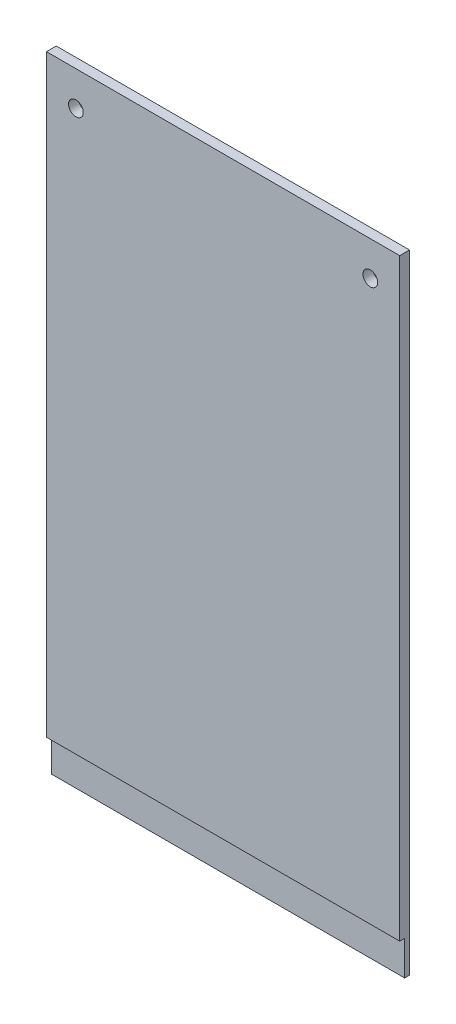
ISO-10303-21;
HEADER;
FILE_DESCRIPTION(('STEP AP214'),'2;1');
FILE_NAME('part.step','',(''),(''),'','','');
FILE_SCHEMA(('AUTOMOTIVE_DESIGN { 1 0 10303 214 1 1 1 1 }'));
ENDSEC;
DATA;
#1=APPLICATION_CONTEXT('core data for automotive mechanical design processes');
#2=APPLICATION_PROTOCOL_DEFINITION('international standard','automotive_design',2000,#1);
#3=PRODUCT_CONTEXT('',#1,'mechanical');
#4=PRODUCT('Part','Part','',(#3));
#5=PRODUCT_RELATED_PRODUCT_CATEGORY('part','',(#4));
#6=PRODUCT_DEFINITION_FORMATION('','',#4);
#7=PRODUCT_DEFINITION_CONTEXT('part definition',#1,'design');
#8=PRODUCT_DEFINITION('design','',#6,#7);
#9=PRODUCT_DEFINITION_SHAPE('','',#8);
#10=(LENGTH_UNIT() NAMED_UNIT(*) SI_UNIT(.MILLI.,.METRE.));
#11=(NAMED_UNIT(*) PLANE_ANGLE_UNIT() SI_UNIT($,.RADIAN.));
#12=(NAMED_UNIT(*) SI_UNIT($,.STERADIAN.) SOLID_ANGLE_UNIT());
#13=UNCERTAINTY_MEASURE_WITH_UNIT(LENGTH_MEASURE(1.E-05),#10,'distance_accuracy_value','');
#14=(GEOMETRIC_REPRESENTATION_CONTEXT(3) GLOBAL_UNCERTAINTY_ASSIGNED_CONTEXT((#13)) GLOBAL_UNIT_ASSIGNED_CONTEXT((#10,
#11,#12)) REPRESENTATION_CONTEXT('',''));
#15=CARTESIAN_POINT('',(0.,0.,0.));
#16=DIRECTION('',(0.,0.,1.));
#17=DIRECTION('',(1.,0.,0.));
#18=AXIS2_PLACEMENT_3D('',#15,#16,#17);
#19=CARTESIAN_POINT('',(36.,124.5,2.));
#20=DIRECTION('',(-1.,0.,0.));
#21=DIRECTION('',(0.,-1.,0.));
#22=AXIS2_PLACEMENT_3D('',#19,#20,#21);
#23=PLANE('',#22);
#24=DIRECTION('',(0.,1.,0.));
#25=VECTOR('',#24,1.);
#26=CARTESIAN_POINT('',(36.,124.5,0.));
#27=LINE('',#26,#25);
#28=CARTESIAN_POINT('',(36.,-4.49999999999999,0.));
#29=VERTEX_POINT('',#28);
#30=CARTESIAN_POINT('',(36.,123.5,0.));
#31=VERTEX_POINT('',#30);
#32=EDGE_CURVE('E142',#29,#31,#27,.T.);
#33=ORIENTED_EDGE('',*,*,#32,.T.);
#34=DIRECTION('',(0.,0.,-1.));
#35=VECTOR('',#34,1.);
#36=CARTESIAN_POINT('',(36.,123.5,2.));
#37=LINE('',#36,#35);
#38=CARTESIAN_POINT('',(36.,123.5,2.));
#39=VERTEX_POINT('',#38);
#40=EDGE_CURVE('E53',#39,#31,#37,.T.);
#41=ORIENTED_EDGE('',*,*,#40,.F.);
#42=DIRECTION('',(0.,1.,0.));
#43=VECTOR('',#42,1.);
#44=CARTESIAN_POINT('',(36.,124.5,2.));
#45=LINE('',#44,#43);
#46=CARTESIAN_POINT('',(36.,2.49999999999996,2.));
#47=VERTEX_POINT('',#46);
#48=EDGE_CURVE('E45',#47,#39,#45,.T.);
#49=ORIENTED_EDGE('',*,*,#48,.F.);
#50=DIRECTION('',(0.,0.,1.));
#51=VECTOR('',#50,1.);
#52=CARTESIAN_POINT('',(36.,2.49999999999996,0.999999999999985));
#53=LINE('',#52,#51);
#54=CARTESIAN_POINT('',(36.,2.49999999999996,0.999999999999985));
#55=VERTEX_POINT('',#54);
#56=EDGE_CURVE('E61',#55,#47,#53,.T.);
#57=ORIENTED_EDGE('',*,*,#56,.F.);
#58=DIRECTION('',(0.,1.,0.));
#59=VECTOR('',#58,1.);
#60=CARTESIAN_POINT('',(36.,-3.00000000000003,0.999999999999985));
#61=LINE('',#60,#59);
#62=CARTESIAN_POINT('',(36.,-4.49999999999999,1.));
#63=VERTEX_POINT('',#62);
#64=EDGE_CURVE('E118',#63,#55,#61,.T.);
#65=ORIENTED_EDGE('',*,*,#64,.F.);
#66=DIRECTION('',(0.,0.,1.));
#67=VECTOR('',#66,1.);
#68=CARTESIAN_POINT('',(36.,-4.49999999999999,0.));
#69=LINE('',#68,#67);
#70=EDGE_CURVE('E127',#29,#63,#69,.T.);
#71=ORIENTED_EDGE('',*,*,#70,.F.);
#72=EDGE_LOOP('',(#33,#41,#49,#57,#65,#71));
#73=FACE_BOUND('',#72,.T.);
#74=ADVANCED_FACE('F37',(#73),#23,.F.);
#75=CARTESIAN_POINT('',(-36.,124.5,2.));
#76=DIRECTION('',(1.,0.,0.));
#77=DIRECTION('',(0.,1.,0.));
#78=AXIS2_PLACEMENT_3D('',#75,#76,#77);
#79=PLANE('',#78);
#80=DIRECTION('',(0.,-1.,0.));
#81=VECTOR('',#80,1.);
#82=CARTESIAN_POINT('',(-36.,124.5,2.));
#83=LINE('',#82,#81);
#84=CARTESIAN_POINT('',(-36.,123.5,2.));
#85=VERTEX_POINT('',#84);
#86=CARTESIAN_POINT('',(-36.,2.49999999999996,2.));
#87=VERTEX_POINT('',#86);
#88=EDGE_CURVE('E11',#85,#87,#83,.T.);
#89=ORIENTED_EDGE('',*,*,#88,.F.);
#90=DIRECTION('',(0.,0.,-1.));
#91=VECTOR('',#90,1.);
#92=CARTESIAN_POINT('',(-36.,123.5,2.));
#93=LINE('',#92,#91);
#94=CARTESIAN_POINT('',(-36.,123.5,0.));
#95=VERTEX_POINT('',#94);
#96=EDGE_CURVE('E89',#85,#95,#93,.T.);
#97=ORIENTED_EDGE('',*,*,#96,.T.);
#98=DIRECTION('',(0.,-1.,0.));
#99=VECTOR('',#98,1.);
#100=CARTESIAN_POINT('',(-36.,124.5,0.));
#101=LINE('',#100,#99);
#102=CARTESIAN_POINT('',(-36.,-4.49999999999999,0.));
#103=VERTEX_POINT('',#102);
#104=EDGE_CURVE('E40',#95,#103,#101,.T.);
#105=ORIENTED_EDGE('',*,*,#104,.T.);
#106=DIRECTION('',(0.,0.,1.));
#107=VECTOR('',#106,1.);
#108=CARTESIAN_POINT('',(-36.,-4.49999999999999,0.));
#109=LINE('',#108,#107);
#110=CARTESIAN_POINT('',(-36.,-4.5,1.));
#111=VERTEX_POINT('',#110);
#112=EDGE_CURVE('E128',#103,#111,#109,.T.);
#113=ORIENTED_EDGE('',*,*,#112,.T.);
#114=DIRECTION('',(0.,1.,0.));
#115=VECTOR('',#114,1.);
#116=CARTESIAN_POINT('',(-36.,-3.00000000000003,0.999999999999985));
#117=LINE('',#116,#115);
#118=CARTESIAN_POINT('',(-36.,2.49999999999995,0.999999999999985));
#119=VERTEX_POINT('',#118);
#120=EDGE_CURVE('E110',#111,#119,#117,.T.);
#121=ORIENTED_EDGE('',*,*,#120,.T.);
#122=DIRECTION('',(0.,0.,1.));
#123=VECTOR('',#122,1.);
#124=CARTESIAN_POINT('',(-36.,2.49999999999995,0.999999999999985));
#125=LINE('',#124,#123);
#126=EDGE_CURVE('E108',#119,#87,#125,.T.);
#127=ORIENTED_EDGE('',*,*,#126,.T.);
#128=EDGE_LOOP('',(#89,#97,#105,#113,#121,#127));
#129=FACE_BOUND('',#128,.T.);
#130=ADVANCED_FACE('F105',(#129),#79,.F.);
#131=CARTESIAN_POINT('',(0.,0.,2.));
#132=DIRECTION('',(0.,0.,1.));
#133=DIRECTION('',(1.,0.,0.));
#134=AXIS2_PLACEMENT_3D('',#131,#132,#133);
#135=PLANE('',#134);
#136=DIRECTION('',(1.,0.,0.));
#137=VECTOR('',#136,1.);
#138=CARTESIAN_POINT('',(-36.,123.5,2.));
#139=LINE('',#138,#137);
#140=EDGE_CURVE('E92',#85,#39,#139,.T.);
#141=ORIENTED_EDGE('',*,*,#140,.F.);
#142=ORIENTED_EDGE('',*,*,#88,.T.);
#143=DIRECTION('',(1.,0.,0.));
#144=VECTOR('',#143,1.);
#145=CARTESIAN_POINT('',(-36.,2.49999999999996,2.));
#146=LINE('',#145,#144);
#147=EDGE_CURVE('E113',#87,#47,#146,.T.);
#148=ORIENTED_EDGE('',*,*,#147,.T.);
#149=ORIENTED_EDGE('',*,*,#48,.T.);
#150=EDGE_LOOP('',(#141,#142,#148,#149));
#151=FACE_BOUND('',#150,.T.);
#152=CARTESIAN_POINT('',(-30.,116.5,2.));
#153=DIRECTION('',(0.,0.,1.));
#154=DIRECTION('',(1.,0.,0.));
#155=AXIS2_PLACEMENT_3D('',#152,#153,#154);
#156=CIRCLE('',#155,1.5);
#157=CARTESIAN_POINT('',(-28.5,116.5,2.));
#158=VERTEX_POINT('',#157);
#159=EDGE_CURVE('E133',#158,#158,#156,.T.);
#160=ORIENTED_EDGE('',*,*,#159,.F.);
#161=EDGE_LOOP('',(#160));
#162=FACE_BOUND('',#161,.T.);
#163=CARTESIAN_POINT('',(30.,116.5,2.));
#164=DIRECTION('',(0.,0.,1.));
#165=DIRECTION('',(1.,0.,0.));
#166=AXIS2_PLACEMENT_3D('',#163,#164,#165);
#167=CIRCLE('',#166,1.5);
#168=CARTESIAN_POINT('',(31.5,116.5,2.));
#169=VERTEX_POINT('',#168);
#170=EDGE_CURVE('E136',#169,#169,#167,.T.);
#171=ORIENTED_EDGE('',*,*,#170,.F.);
#172=EDGE_LOOP('',(#171));
#173=FACE_BOUND('',#172,.T.);
#174=ADVANCED_FACE('F100',(#151,#162,#173),#135,.T.);
#175=CARTESIAN_POINT('',(0.,0.,0.));
#176=DIRECTION('',(0.,0.,1.));
#177=DIRECTION('',(1.,0.,0.));
#178=AXIS2_PLACEMENT_3D('',#175,#176,#177);
#179=PLANE('',#178);
#180=CARTESIAN_POINT('',(-30.,116.5,0.));
#181=DIRECTION('',(0.,0.,1.));
#182=DIRECTION('',(1.,0.,0.));
#183=AXIS2_PLACEMENT_3D('',#180,#181,#182);
#184=CIRCLE('',#183,1.5);
#185=CARTESIAN_POINT('',(-28.5,116.5,0.));
#186=VERTEX_POINT('',#185);
#187=EDGE_CURVE('E130',#186,#186,#184,.T.);
#188=ORIENTED_EDGE('',*,*,#187,.T.);
#189=EDGE_LOOP('',(#188));
#190=FACE_BOUND('',#189,.T.);
#191=CARTESIAN_POINT('',(30.,116.5,0.));
#192=DIRECTION('',(0.,0.,1.));
#193=DIRECTION('',(1.,0.,0.));
#194=AXIS2_PLACEMENT_3D('',#191,#192,#193);
#195=CIRCLE('',#194,1.5);
#196=CARTESIAN_POINT('',(31.5,116.5,0.));
#197=VERTEX_POINT('',#196);
#198=EDGE_CURVE('E139',#197,#197,#195,.T.);
#199=ORIENTED_EDGE('',*,*,#198,.T.);
#200=EDGE_LOOP('',(#199));
#201=FACE_BOUND('',#200,.T.);
#202=ORIENTED_EDGE('',*,*,#104,.F.);
#203=DIRECTION('',(1.,0.,0.));
#204=VECTOR('',#203,1.);
#205=CARTESIAN_POINT('',(-36.,123.5,0.));
#206=LINE('',#205,#204);
#207=EDGE_CURVE('E93',#95,#31,#206,.T.);
#208=ORIENTED_EDGE('',*,*,#207,.T.);
#209=ORIENTED_EDGE('',*,*,#32,.F.);
#210=DIRECTION('',(-1.,0.,0.));
#211=VECTOR('',#210,1.);
#212=CARTESIAN_POINT('',(-36.,-4.49999999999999,0.));
#213=LINE('',#212,#211);
#214=EDGE_CURVE('E123',#29,#103,#213,.T.);
#215=ORIENTED_EDGE('',*,*,#214,.T.);
#216=EDGE_LOOP('',(#202,#208,#209,#215));
#217=FACE_BOUND('',#216,.T.);
#218=ADVANCED_FACE('F155',(#190,#201,#217),#179,.F.);
#219=CARTESIAN_POINT('',(30.,116.5,0.));
#220=DIRECTION('',(0.,0.,1.));
#221=DIRECTION('',(1.,0.,0.));
#222=AXIS2_PLACEMENT_3D('',#219,#220,#221);
#223=CYLINDRICAL_SURFACE('',#222,1.5);
#224=ORIENTED_EDGE('',*,*,#198,.F.);
#225=EDGE_LOOP('',(#224));
#226=FACE_BOUND('',#225,.T.);
#227=ORIENTED_EDGE('',*,*,#170,.T.);
#228=EDGE_LOOP('',(#227));
#229=FACE_BOUND('',#228,.T.);
#230=ADVANCED_FACE('F171',(#226,#229),#223,.F.);
#231=CARTESIAN_POINT('',(-30.,116.5,0.));
#232=DIRECTION('',(0.,0.,1.));
#233=DIRECTION('',(1.,0.,0.));
#234=AXIS2_PLACEMENT_3D('',#231,#232,#233);
#235=CYLINDRICAL_SURFACE('',#234,1.5);
#236=ORIENTED_EDGE('',*,*,#187,.F.);
#237=EDGE_LOOP('',(#236));
#238=FACE_BOUND('',#237,.T.);
#239=ORIENTED_EDGE('',*,*,#159,.T.);
#240=EDGE_LOOP('',(#239));
#241=FACE_BOUND('',#240,.T.);
#242=ADVANCED_FACE('F176',(#238,#241),#235,.F.);
#243=CARTESIAN_POINT('',(-36.,-4.49999999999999,0.));
#244=DIRECTION('',(0.,1.,0.));
#245=DIRECTION('',(0.,0.,1.));
#246=AXIS2_PLACEMENT_3D('',#243,#244,#245);
#247=PLANE('',#246);
#248=ORIENTED_EDGE('',*,*,#70,.T.);
#249=DIRECTION('',(1.,0.,0.));
#250=VECTOR('',#249,1.);
#251=CARTESIAN_POINT('',(-36.,-4.5,1.));
#252=LINE('',#251,#250);
#253=EDGE_CURVE('E121',#111,#63,#252,.T.);
#254=ORIENTED_EDGE('',*,*,#253,.F.);
#255=ORIENTED_EDGE('',*,*,#112,.F.);
#256=ORIENTED_EDGE('',*,*,#214,.F.);
#257=EDGE_LOOP('',(#248,#254,#255,#256));
#258=FACE_BOUND('',#257,.T.);
#259=ADVANCED_FACE('F153',(#258),#247,.F.);
#260=CARTESIAN_POINT('',(-36.,2.49999999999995,0.999999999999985));
#261=DIRECTION('',(0.,1.,0.));
#262=DIRECTION('',(0.,0.,1.));
#263=AXIS2_PLACEMENT_3D('',#260,#261,#262);
#264=PLANE('',#263);
#265=ORIENTED_EDGE('',*,*,#56,.T.);
#266=ORIENTED_EDGE('',*,*,#147,.F.);
#267=ORIENTED_EDGE('',*,*,#126,.F.);
#268=DIRECTION('',(1.,0.,0.));
#269=VECTOR('',#268,1.);
#270=CARTESIAN_POINT('',(-36.,2.49999999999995,0.999999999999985));
#271=LINE('',#270,#269);
#272=EDGE_CURVE('E111',#119,#55,#271,.T.);
#273=ORIENTED_EDGE('',*,*,#272,.T.);
#274=EDGE_LOOP('',(#265,#266,#267,#273));
#275=FACE_BOUND('',#274,.T.);
#276=ADVANCED_FACE('F183',(#275),#264,.F.);
#277=CARTESIAN_POINT('',(-36.,-3.00000000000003,0.999999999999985));
#278=DIRECTION('',(0.,0.,-1.));
#279=DIRECTION('',(-1.,0.,0.));
#280=AXIS2_PLACEMENT_3D('',#277,#278,#279);
#281=PLANE('',#280);
#282=ORIENTED_EDGE('',*,*,#64,.T.);
#283=ORIENTED_EDGE('',*,*,#272,.F.);
#284=ORIENTED_EDGE('',*,*,#120,.F.);
#285=ORIENTED_EDGE('',*,*,#253,.T.);
#286=EDGE_LOOP('',(#282,#283,#284,#285));
#287=FACE_BOUND('',#286,.T.);
#288=ADVANCED_FACE('F159',(#287),#281,.F.);
#289=CARTESIAN_POINT('',(-36.,123.5,2.));
#290=DIRECTION('',(0.,-1.,0.));
#291=DIRECTION('',(1.,0.,0.));
#292=AXIS2_PLACEMENT_3D('',#289,#290,#291);
#293=PLANE('',#292);
#294=ORIENTED_EDGE('',*,*,#40,.T.);
#295=ORIENTED_EDGE('',*,*,#207,.F.);
#296=ORIENTED_EDGE('',*,*,#96,.F.);
#297=ORIENTED_EDGE('',*,*,#140,.T.);
#298=EDGE_LOOP('',(#294,#295,#296,#297));
#299=FACE_BOUND('',#298,.T.);
#300=ADVANCED_FACE('F91',(#299),#293,.F.);
#301=CLOSED_SHELL('',(#74,#130,#174,#218,#230,#242,#259,#276,#288,#300));
#302=MANIFOLD_SOLID_BREP('B2',#301);
#303=ADVANCED_BREP_SHAPE_REPRESENTATION('',(#18,#302),#14);
#304=SHAPE_DEFINITION_REPRESENTATION(#9,#303);
ENDSEC;
END-ISO-10303-21;
